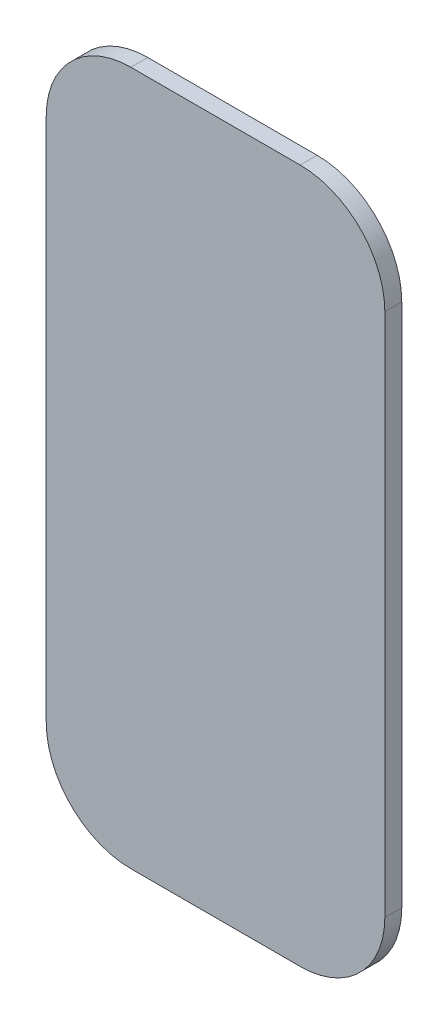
from build123d import *

# Parameters (mm, degrees)
BOSS_EXTRUDE1_DEPTH = 50


with BuildPart() as part:
    # Sketch1 → Boss-Extrude1 (new body)
    with BuildSketch(Plane.XY):
        with BuildLine():
            Line((-250, 1025), (250, 1025))
            ThreePointArc((250, 1025), (426.776695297, 951.776695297), (500, 775))
            Line((500, 775), (500, -775))
            ThreePointArc((500, -775), (426.776695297, -951.776695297), (250, -1025))
            Line((250, -1025), (-250, -1025))
            ThreePointArc((-250, -1025), (-426.776695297, -951.776695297), (-500, -775))
            Line((-500, -775), (-500, 775))
            ThreePointArc((-500, 775), (-426.776695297, 951.776695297), (-250, 1025))
        make_face()
    extrude(amount=-BOSS_EXTRUDE1_DEPTH)


solid = part.part
